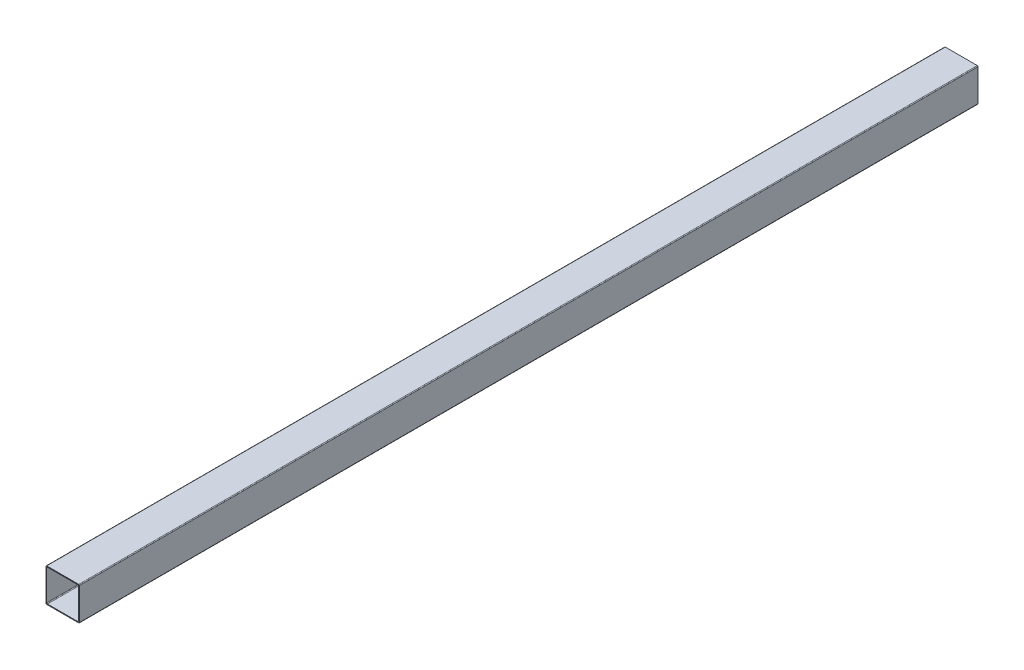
from build123d import *

# Parameters (mm, degrees)
BOSS_EXTRU_1_DEPTH = 2420


with BuildPart() as part:
    # Esquisse1 → Boss.-Extru.1 (new body)
    with BuildSketch(Plane.XY):
        with BuildLine():
            Line((43, -45), (-43, -45))
            ThreePointArc((-43, -45), (-44.414213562, -44.414213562), (-45, -43))
            Line((-45, -43), (-45, 43))
            ThreePointArc((-45, 43), (-44.414213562, 44.414213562), (-43, 45))
            Line((-43, 45), (43, 45))
            ThreePointArc((43, 45), (44.414213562, 44.414213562), (45, 43))
            Line((45, 43), (45, -43))
            ThreePointArc((45, -43), (44.414213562, -44.414213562), (43, -45))
        make_face()
        with BuildLine():
            Line((41, -43), (-41, -43))
            ThreePointArc((-41, -43), (-42.414213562, -42.414213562), (-43, -41))
            Line((-43, -41), (-43, 41))
            ThreePointArc((-43, 41), (-42.414213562, 42.414213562), (-41, 43))
            Line((-41, 43), (41, 43))
            ThreePointArc((41, 43), (42.414213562, 42.414213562), (43, 41))
            Line((43, 41), (43, -41))
            ThreePointArc((43, -41), (42.414213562, -42.414213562), (41, -43))
        make_face(mode=Mode.SUBTRACT)
    extrude(amount=BOSS_EXTRU_1_DEPTH)


solid = part.part
